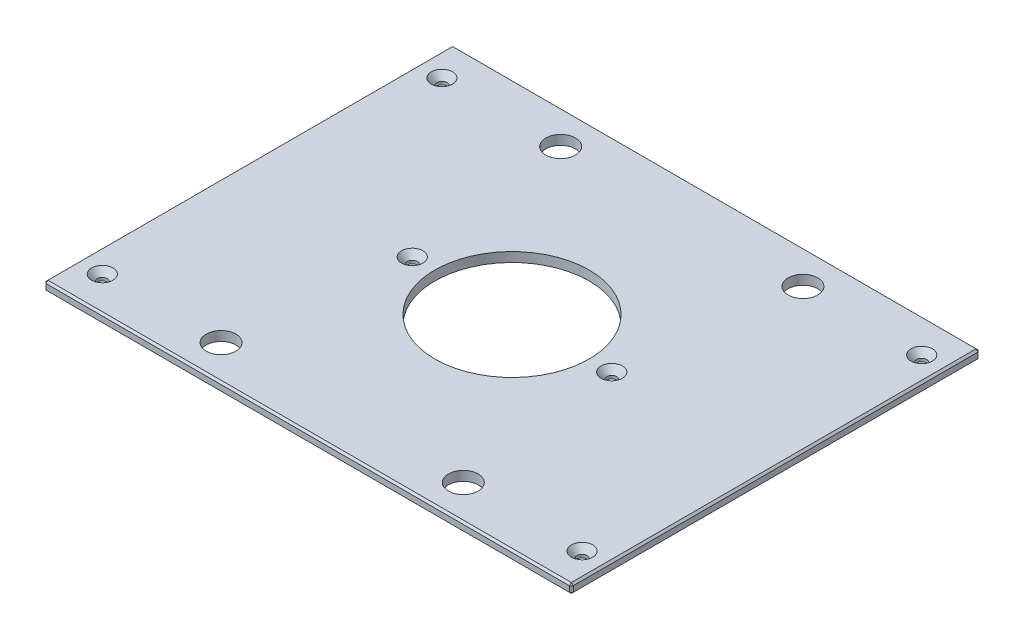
ISO-10303-21;
HEADER;
FILE_DESCRIPTION(('STEP AP214'),'2;1');
FILE_NAME('part.step','',(''),(''),'','','');
FILE_SCHEMA(('AUTOMOTIVE_DESIGN { 1 0 10303 214 1 1 1 1 }'));
ENDSEC;
DATA;
#1=APPLICATION_CONTEXT('core data for automotive mechanical design processes');
#2=APPLICATION_PROTOCOL_DEFINITION('international standard','automotive_design',2000,#1);
#3=PRODUCT_CONTEXT('',#1,'mechanical');
#4=PRODUCT('Part','Part','',(#3));
#5=PRODUCT_RELATED_PRODUCT_CATEGORY('part','',(#4));
#6=PRODUCT_DEFINITION_FORMATION('','',#4);
#7=PRODUCT_DEFINITION_CONTEXT('part definition',#1,'design');
#8=PRODUCT_DEFINITION('design','',#6,#7);
#9=PRODUCT_DEFINITION_SHAPE('','',#8);
#10=(LENGTH_UNIT() NAMED_UNIT(*) SI_UNIT(.MILLI.,.METRE.));
#11=(NAMED_UNIT(*) PLANE_ANGLE_UNIT() SI_UNIT($,.RADIAN.));
#12=(NAMED_UNIT(*) SI_UNIT($,.STERADIAN.) SOLID_ANGLE_UNIT());
#13=UNCERTAINTY_MEASURE_WITH_UNIT(LENGTH_MEASURE(1.E-05),#10,'distance_accuracy_value','');
#14=(GEOMETRIC_REPRESENTATION_CONTEXT(3) GLOBAL_UNCERTAINTY_ASSIGNED_CONTEXT((#13)) GLOBAL_UNIT_ASSIGNED_CONTEXT((#10,
#11,#12)) REPRESENTATION_CONTEXT('',''));
#15=CARTESIAN_POINT('',(0.,0.,0.));
#16=DIRECTION('',(0.,0.,1.));
#17=DIRECTION('',(1.,0.,0.));
#18=AXIS2_PLACEMENT_3D('',#15,#16,#17);
#19=CARTESIAN_POINT('',(-176.2125,6.35,-136.525));
#20=DIRECTION('',(1.,0.,0.));
#21=DIRECTION('',(0.,0.,-1.));
#22=AXIS2_PLACEMENT_3D('',#19,#20,#21);
#23=PLANE('',#22);
#24=DIRECTION('',(0.,0.,-1.));
#25=VECTOR('',#24,1.);
#26=CARTESIAN_POINT('',(-176.2125,5.08000000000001,-136.525));
#27=LINE('',#26,#25);
#28=CARTESIAN_POINT('',(-176.2125,5.08000000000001,135.255));
#29=VERTEX_POINT('',#28);
#30=CARTESIAN_POINT('',(-176.2125,5.08000000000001,-135.255));
#31=VERTEX_POINT('',#30);
#32=EDGE_CURVE('E135',#29,#31,#27,.T.);
#33=ORIENTED_EDGE('',*,*,#32,.T.);
#34=DIRECTION('',(0.,-1.,0.));
#35=VECTOR('',#34,1.);
#36=CARTESIAN_POINT('',(-176.2125,6.35,-135.255));
#37=LINE('',#36,#35);
#38=CARTESIAN_POINT('',(-176.2125,1.26999999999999,-135.255));
#39=VERTEX_POINT('',#38);
#40=EDGE_CURVE('E131',#31,#39,#37,.T.);
#41=ORIENTED_EDGE('',*,*,#40,.T.);
#42=DIRECTION('',(0.,0.,1.));
#43=VECTOR('',#42,1.);
#44=CARTESIAN_POINT('',(-176.2125,1.26999999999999,-136.525));
#45=LINE('',#44,#43);
#46=CARTESIAN_POINT('',(-176.2125,1.26999999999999,135.255));
#47=VERTEX_POINT('',#46);
#48=EDGE_CURVE('E126',#39,#47,#45,.T.);
#49=ORIENTED_EDGE('',*,*,#48,.T.);
#50=DIRECTION('',(0.,1.,0.));
#51=VECTOR('',#50,1.);
#52=CARTESIAN_POINT('',(-176.2125,6.35,135.255));
#53=LINE('',#52,#51);
#54=EDGE_CURVE('E128',#47,#29,#53,.T.);
#55=ORIENTED_EDGE('',*,*,#54,.T.);
#56=EDGE_LOOP('',(#33,#41,#49,#55));
#57=FACE_BOUND('',#56,.T.);
#58=ADVANCED_FACE('F35',(#57),#23,.F.);
#59=CARTESIAN_POINT('',(-176.2125,6.35,136.525));
#60=DIRECTION('',(0.,0.,-1.));
#61=DIRECTION('',(-1.,0.,0.));
#62=AXIS2_PLACEMENT_3D('',#59,#60,#61);
#63=PLANE('',#62);
#64=DIRECTION('',(1.,0.,0.));
#65=VECTOR('',#64,1.);
#66=CARTESIAN_POINT('',(-176.2125,1.26999999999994,136.525));
#67=LINE('',#66,#65);
#68=CARTESIAN_POINT('',(-174.9425,1.26999999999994,136.525));
#69=VERTEX_POINT('',#68);
#70=CARTESIAN_POINT('',(174.9425,1.26999999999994,136.525));
#71=VERTEX_POINT('',#70);
#72=EDGE_CURVE('E58',#69,#71,#67,.T.);
#73=ORIENTED_EDGE('',*,*,#72,.T.);
#74=DIRECTION('',(0.,1.,0.));
#75=VECTOR('',#74,1.);
#76=CARTESIAN_POINT('',(174.9425,6.35,136.525));
#77=LINE('',#76,#75);
#78=CARTESIAN_POINT('',(174.9425,5.08000000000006,136.525));
#79=VERTEX_POINT('',#78);
#80=EDGE_CURVE('E11',#71,#79,#77,.T.);
#81=ORIENTED_EDGE('',*,*,#80,.T.);
#82=DIRECTION('',(-1.,0.,0.));
#83=VECTOR('',#82,1.);
#84=CARTESIAN_POINT('',(-176.2125,5.08000000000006,136.525));
#85=LINE('',#84,#83);
#86=CARTESIAN_POINT('',(-174.9425,5.08000000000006,136.525));
#87=VERTEX_POINT('',#86);
#88=EDGE_CURVE('E44',#79,#87,#85,.T.);
#89=ORIENTED_EDGE('',*,*,#88,.T.);
#90=DIRECTION('',(0.,-1.,0.));
#91=VECTOR('',#90,1.);
#92=CARTESIAN_POINT('',(-174.9425,6.35,136.525));
#93=LINE('',#92,#91);
#94=EDGE_CURVE('E279',#87,#69,#93,.T.);
#95=ORIENTED_EDGE('',*,*,#94,.T.);
#96=EDGE_LOOP('',(#73,#81,#89,#95));
#97=FACE_BOUND('',#96,.T.);
#98=ADVANCED_FACE('F348',(#97),#63,.F.);
#99=CARTESIAN_POINT('',(176.2125,6.35,-136.525));
#100=DIRECTION('',(-1.,0.,0.));
#101=DIRECTION('',(0.,0.,1.));
#102=AXIS2_PLACEMENT_3D('',#99,#100,#101);
#103=PLANE('',#102);
#104=DIRECTION('',(0.,0.,-1.));
#105=VECTOR('',#104,1.);
#106=CARTESIAN_POINT('',(176.2125,1.26999999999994,-136.525));
#107=LINE('',#106,#105);
#108=CARTESIAN_POINT('',(176.2125,1.26999999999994,135.255));
#109=VERTEX_POINT('',#108);
#110=CARTESIAN_POINT('',(176.2125,1.26999999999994,-135.255));
#111=VERTEX_POINT('',#110);
#112=EDGE_CURVE('E274',#109,#111,#107,.T.);
#113=ORIENTED_EDGE('',*,*,#112,.T.);
#114=DIRECTION('',(0.,1.,0.));
#115=VECTOR('',#114,1.);
#116=CARTESIAN_POINT('',(176.2125,6.35,-135.255));
#117=LINE('',#116,#115);
#118=CARTESIAN_POINT('',(176.2125,5.08000000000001,-135.255));
#119=VERTEX_POINT('',#118);
#120=EDGE_CURVE('E276',#111,#119,#117,.T.);
#121=ORIENTED_EDGE('',*,*,#120,.T.);
#122=DIRECTION('',(0.,0.,1.));
#123=VECTOR('',#122,1.);
#124=CARTESIAN_POINT('',(176.2125,5.08000000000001,136.525));
#125=LINE('',#124,#123);
#126=CARTESIAN_POINT('',(176.2125,5.08000000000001,135.255));
#127=VERTEX_POINT('',#126);
#128=EDGE_CURVE('E272',#119,#127,#125,.T.);
#129=ORIENTED_EDGE('',*,*,#128,.T.);
#130=DIRECTION('',(0.,-1.,0.));
#131=VECTOR('',#130,1.);
#132=CARTESIAN_POINT('',(176.2125,6.35,135.255));
#133=LINE('',#132,#131);
#134=EDGE_CURVE('E270',#127,#109,#133,.T.);
#135=ORIENTED_EDGE('',*,*,#134,.T.);
#136=EDGE_LOOP('',(#113,#121,#129,#135));
#137=FACE_BOUND('',#136,.T.);
#138=ADVANCED_FACE('F335',(#137),#103,.F.);
#139=CARTESIAN_POINT('',(-176.2125,6.35,-136.525));
#140=DIRECTION('',(0.,0.,1.));
#141=DIRECTION('',(1.,0.,0.));
#142=AXIS2_PLACEMENT_3D('',#139,#140,#141);
#143=PLANE('',#142);
#144=DIRECTION('',(-1.,0.,0.));
#145=VECTOR('',#144,1.);
#146=CARTESIAN_POINT('',(-176.2125,1.26999999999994,-136.525));
#147=LINE('',#146,#145);
#148=CARTESIAN_POINT('',(174.9425,1.26999999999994,-136.525));
#149=VERTEX_POINT('',#148);
#150=CARTESIAN_POINT('',(-174.9425,1.26999999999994,-136.525));
#151=VERTEX_POINT('',#150);
#152=EDGE_CURVE('E246',#149,#151,#147,.T.);
#153=ORIENTED_EDGE('',*,*,#152,.T.);
#154=DIRECTION('',(0.,1.,0.));
#155=VECTOR('',#154,1.);
#156=CARTESIAN_POINT('',(-174.9425,6.35,-136.525));
#157=LINE('',#156,#155);
#158=CARTESIAN_POINT('',(-174.9425,5.08000000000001,-136.525));
#159=VERTEX_POINT('',#158);
#160=EDGE_CURVE('E250',#151,#159,#157,.T.);
#161=ORIENTED_EDGE('',*,*,#160,.T.);
#162=DIRECTION('',(1.,0.,0.));
#163=VECTOR('',#162,1.);
#164=CARTESIAN_POINT('',(176.2125,5.08000000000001,-136.525));
#165=LINE('',#164,#163);
#166=CARTESIAN_POINT('',(174.9425,5.08000000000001,-136.525));
#167=VERTEX_POINT('',#166);
#168=EDGE_CURVE('E248',#159,#167,#165,.T.);
#169=ORIENTED_EDGE('',*,*,#168,.T.);
#170=DIRECTION('',(0.,-1.,0.));
#171=VECTOR('',#170,1.);
#172=CARTESIAN_POINT('',(174.9425,6.35,-136.525));
#173=LINE('',#172,#171);
#174=EDGE_CURVE('E244',#167,#149,#173,.T.);
#175=ORIENTED_EDGE('',*,*,#174,.T.);
#176=EDGE_LOOP('',(#153,#161,#169,#175));
#177=FACE_BOUND('',#176,.T.);
#178=ADVANCED_FACE('F309',(#177),#143,.F.);
#179=CARTESIAN_POINT('',(0.,6.35,0.));
#180=DIRECTION('',(0.,1.,0.));
#181=DIRECTION('',(0.,0.,1.));
#182=AXIS2_PLACEMENT_3D('',#179,#180,#181);
#183=PLANE('',#182);
#184=CARTESIAN_POINT('',(160.3375,6.35,-113.50498));
#185=DIRECTION('',(0.,1.,0.));
#186=DIRECTION('',(0.,0.,1.));
#187=AXIS2_PLACEMENT_3D('',#184,#185,#186);
#188=CIRCLE('',#187,7.13739999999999);
#189=CARTESIAN_POINT('',(160.3375,6.35,-106.36758));
#190=VERTEX_POINT('',#189);
#191=EDGE_CURVE('E752',#190,#190,#188,.T.);
#192=ORIENTED_EDGE('',*,*,#191,.F.);
#193=EDGE_LOOP('',(#192));
#194=FACE_BOUND('',#193,.T.);
#195=CARTESIAN_POINT('',(160.3375,6.35,113.50498));
#196=DIRECTION('',(0.,1.,0.));
#197=DIRECTION('',(0.,0.,1.));
#198=AXIS2_PLACEMENT_3D('',#195,#196,#197);
#199=CIRCLE('',#198,7.13739999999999);
#200=CARTESIAN_POINT('',(160.3375,6.35,120.64238));
#201=VERTEX_POINT('',#200);
#202=EDGE_CURVE('E756',#201,#201,#199,.T.);
#203=ORIENTED_EDGE('',*,*,#202,.F.);
#204=EDGE_LOOP('',(#203));
#205=FACE_BOUND('',#204,.T.);
#206=CARTESIAN_POINT('',(-160.3375,6.35,113.50498));
#207=DIRECTION('',(0.,1.,0.));
#208=DIRECTION('',(0.,0.,1.));
#209=AXIS2_PLACEMENT_3D('',#206,#207,#208);
#210=CIRCLE('',#209,7.13739999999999);
#211=CARTESIAN_POINT('',(-160.3375,6.35,120.64238));
#212=VERTEX_POINT('',#211);
#213=EDGE_CURVE('E760',#212,#212,#210,.T.);
#214=ORIENTED_EDGE('',*,*,#213,.F.);
#215=EDGE_LOOP('',(#214));
#216=FACE_BOUND('',#215,.T.);
#217=CARTESIAN_POINT('',(-66.675,6.35,0.));
#218=DIRECTION('',(0.,1.,0.));
#219=DIRECTION('',(0.,0.,1.));
#220=AXIS2_PLACEMENT_3D('',#217,#218,#219);
#221=CIRCLE('',#220,7.1374);
#222=CARTESIAN_POINT('',(-66.675,6.35,7.1374));
#223=VERTEX_POINT('',#222);
#224=EDGE_CURVE('E764',#223,#223,#221,.T.);
#225=ORIENTED_EDGE('',*,*,#224,.F.);
#226=EDGE_LOOP('',(#225));
#227=FACE_BOUND('',#226,.T.);
#228=CARTESIAN_POINT('',(66.675,6.35,0.));
#229=DIRECTION('',(0.,1.,0.));
#230=DIRECTION('',(0.,0.,1.));
#231=AXIS2_PLACEMENT_3D('',#228,#229,#230);
#232=CIRCLE('',#231,7.1374);
#233=CARTESIAN_POINT('',(66.675,6.35,7.1374));
#234=VERTEX_POINT('',#233);
#235=EDGE_CURVE('E768',#234,#234,#232,.T.);
#236=ORIENTED_EDGE('',*,*,#235,.F.);
#237=EDGE_LOOP('',(#236));
#238=FACE_BOUND('',#237,.T.);
#239=CARTESIAN_POINT('',(-160.3375,6.35,-113.50498));
#240=DIRECTION('',(0.,1.,0.));
#241=DIRECTION('',(0.,0.,1.));
#242=AXIS2_PLACEMENT_3D('',#239,#240,#241);
#243=CIRCLE('',#242,7.13739999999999);
#244=CARTESIAN_POINT('',(-160.3375,6.35,-106.36758));
#245=VERTEX_POINT('',#244);
#246=EDGE_CURVE('E771',#245,#245,#243,.T.);
#247=ORIENTED_EDGE('',*,*,#246,.F.);
#248=EDGE_LOOP('',(#247));
#249=FACE_BOUND('',#248,.T.);
#250=DIRECTION('',(0.,0.,-1.));
#251=VECTOR('',#250,1.);
#252=CARTESIAN_POINT('',(174.9425,6.35,-136.525));
#253=LINE('',#252,#251);
#254=CARTESIAN_POINT('',(174.9425,6.35,135.255));
#255=VERTEX_POINT('',#254);
#256=CARTESIAN_POINT('',(174.9425,6.35,-135.255));
#257=VERTEX_POINT('',#256);
#258=EDGE_CURVE('E257',#255,#257,#253,.T.);
#259=ORIENTED_EDGE('',*,*,#258,.T.);
#260=DIRECTION('',(-1.,0.,0.));
#261=VECTOR('',#260,1.);
#262=CARTESIAN_POINT('',(-176.2125,6.35,-135.255));
#263=LINE('',#262,#261);
#264=CARTESIAN_POINT('',(-174.9425,6.35,-135.255));
#265=VERTEX_POINT('',#264);
#266=EDGE_CURVE('E259',#257,#265,#263,.T.);
#267=ORIENTED_EDGE('',*,*,#266,.T.);
#268=DIRECTION('',(0.,0.,1.));
#269=VECTOR('',#268,1.);
#270=CARTESIAN_POINT('',(-174.9425,6.35,136.525));
#271=LINE('',#270,#269);
#272=CARTESIAN_POINT('',(-174.9425,6.35,135.255));
#273=VERTEX_POINT('',#272);
#274=EDGE_CURVE('E255',#265,#273,#271,.T.);
#275=ORIENTED_EDGE('',*,*,#274,.T.);
#276=DIRECTION('',(1.,0.,0.));
#277=VECTOR('',#276,1.);
#278=CARTESIAN_POINT('',(176.2125,6.35,135.255));
#279=LINE('',#278,#277);
#280=EDGE_CURVE('E253',#273,#255,#279,.T.);
#281=ORIENTED_EDGE('',*,*,#280,.T.);
#282=EDGE_LOOP('',(#259,#267,#275,#281));
#283=FACE_BOUND('',#282,.T.);
#284=CARTESIAN_POINT('',(80.9625,6.35,-113.50498));
#285=DIRECTION('',(0.,1.,0.));
#286=DIRECTION('',(0.,0.,1.));
#287=AXIS2_PLACEMENT_3D('',#284,#285,#286);
#288=CIRCLE('',#287,9.921875);
#289=CARTESIAN_POINT('',(80.9625,6.35,-103.583105));
#290=VERTEX_POINT('',#289);
#291=EDGE_CURVE('E204',#290,#290,#288,.T.);
#292=ORIENTED_EDGE('',*,*,#291,.F.);
#293=EDGE_LOOP('',(#292));
#294=FACE_BOUND('',#293,.T.);
#295=CARTESIAN_POINT('',(-80.9625,6.35,-113.50498));
#296=DIRECTION('',(0.,1.,0.));
#297=DIRECTION('',(0.,0.,1.));
#298=AXIS2_PLACEMENT_3D('',#295,#296,#297);
#299=CIRCLE('',#298,9.921875);
#300=CARTESIAN_POINT('',(-80.9625,6.35,-103.583105));
#301=VERTEX_POINT('',#300);
#302=EDGE_CURVE('E214',#301,#301,#299,.T.);
#303=ORIENTED_EDGE('',*,*,#302,.F.);
#304=EDGE_LOOP('',(#303));
#305=FACE_BOUND('',#304,.T.);
#306=CARTESIAN_POINT('',(80.9625,6.35,113.50498));
#307=DIRECTION('',(0.,1.,0.));
#308=DIRECTION('',(0.,0.,1.));
#309=AXIS2_PLACEMENT_3D('',#306,#307,#308);
#310=CIRCLE('',#309,9.921875);
#311=CARTESIAN_POINT('',(80.9625,6.35,123.426855));
#312=VERTEX_POINT('',#311);
#313=EDGE_CURVE('E225',#312,#312,#310,.T.);
#314=ORIENTED_EDGE('',*,*,#313,.F.);
#315=EDGE_LOOP('',(#314));
#316=FACE_BOUND('',#315,.T.);
#317=CARTESIAN_POINT('',(-80.9625,6.35,113.50498));
#318=DIRECTION('',(0.,1.,0.));
#319=DIRECTION('',(0.,0.,1.));
#320=AXIS2_PLACEMENT_3D('',#317,#318,#319);
#321=CIRCLE('',#320,9.921875);
#322=CARTESIAN_POINT('',(-80.9625,6.35,123.426855));
#323=VERTEX_POINT('',#322);
#324=EDGE_CURVE('E231',#323,#323,#321,.T.);
#325=ORIENTED_EDGE('',*,*,#324,.F.);
#326=EDGE_LOOP('',(#325));
#327=FACE_BOUND('',#326,.T.);
#328=CARTESIAN_POINT('',(0.,6.35,0.));
#329=DIRECTION('',(0.,1.,0.));
#330=DIRECTION('',(0.,0.,1.));
#331=AXIS2_PLACEMENT_3D('',#328,#329,#330);
#332=CIRCLE('',#331,51.562);
#333=CARTESIAN_POINT('',(0.,6.35,51.562));
#334=VERTEX_POINT('',#333);
#335=EDGE_CURVE('E237',#334,#334,#332,.T.);
#336=ORIENTED_EDGE('',*,*,#335,.F.);
#337=EDGE_LOOP('',(#336));
#338=FACE_BOUND('',#337,.T.);
#339=ADVANCED_FACE('F357',(#194,#205,#216,#227,#238,#249,#283,#294,#305,#316,#327,#338),#183,.T.);
#340=CARTESIAN_POINT('',(0.,0.,0.));
#341=DIRECTION('',(0.,1.,0.));
#342=DIRECTION('',(0.,0.,1.));
#343=AXIS2_PLACEMENT_3D('',#340,#341,#342);
#344=PLANE('',#343);
#345=CARTESIAN_POINT('',(160.3375,0.,-113.50498));
#346=DIRECTION('',(0.,1.,0.));
#347=DIRECTION('',(0.,0.,1.));
#348=AXIS2_PLACEMENT_3D('',#345,#346,#347);
#349=CIRCLE('',#348,3.3782);
#350=CARTESIAN_POINT('',(160.3375,0.,-110.12678));
#351=VERTEX_POINT('',#350);
#352=EDGE_CURVE('E805',#351,#351,#349,.T.);
#353=ORIENTED_EDGE('',*,*,#352,.T.);
#354=EDGE_LOOP('',(#353));
#355=FACE_BOUND('',#354,.T.);
#356=CARTESIAN_POINT('',(160.3375,0.,113.50498));
#357=DIRECTION('',(0.,1.,0.));
#358=DIRECTION('',(0.,0.,1.));
#359=AXIS2_PLACEMENT_3D('',#356,#357,#358);
#360=CIRCLE('',#359,3.3782);
#361=CARTESIAN_POINT('',(160.3375,0.,116.88318));
#362=VERTEX_POINT('',#361);
#363=EDGE_CURVE('E798',#362,#362,#360,.T.);
#364=ORIENTED_EDGE('',*,*,#363,.T.);
#365=EDGE_LOOP('',(#364));
#366=FACE_BOUND('',#365,.T.);
#367=CARTESIAN_POINT('',(-160.3375,0.,113.50498));
#368=DIRECTION('',(0.,1.,0.));
#369=DIRECTION('',(0.,0.,1.));
#370=AXIS2_PLACEMENT_3D('',#367,#368,#369);
#371=CIRCLE('',#370,3.3782);
#372=CARTESIAN_POINT('',(-160.3375,0.,116.88318));
#373=VERTEX_POINT('',#372);
#374=EDGE_CURVE('E791',#373,#373,#371,.T.);
#375=ORIENTED_EDGE('',*,*,#374,.T.);
#376=EDGE_LOOP('',(#375));
#377=FACE_BOUND('',#376,.T.);
#378=CARTESIAN_POINT('',(-66.675,0.,0.));
#379=DIRECTION('',(0.,1.,0.));
#380=DIRECTION('',(0.,0.,1.));
#381=AXIS2_PLACEMENT_3D('',#378,#379,#380);
#382=CIRCLE('',#381,3.3782);
#383=CARTESIAN_POINT('',(-66.675,0.,3.3782));
#384=VERTEX_POINT('',#383);
#385=EDGE_CURVE('E784',#384,#384,#382,.T.);
#386=ORIENTED_EDGE('',*,*,#385,.T.);
#387=EDGE_LOOP('',(#386));
#388=FACE_BOUND('',#387,.T.);
#389=CARTESIAN_POINT('',(66.675,0.,0.));
#390=DIRECTION('',(0.,1.,0.));
#391=DIRECTION('',(0.,0.,1.));
#392=AXIS2_PLACEMENT_3D('',#389,#390,#391);
#393=CIRCLE('',#392,3.3782);
#394=CARTESIAN_POINT('',(66.675,0.,3.3782));
#395=VERTEX_POINT('',#394);
#396=EDGE_CURVE('E774',#395,#395,#393,.T.);
#397=ORIENTED_EDGE('',*,*,#396,.T.);
#398=EDGE_LOOP('',(#397));
#399=FACE_BOUND('',#398,.T.);
#400=CARTESIAN_POINT('',(-160.3375,0.,-113.50498));
#401=DIRECTION('',(0.,1.,0.));
#402=DIRECTION('',(0.,0.,1.));
#403=AXIS2_PLACEMENT_3D('',#400,#401,#402);
#404=CIRCLE('',#403,3.3782);
#405=CARTESIAN_POINT('',(-160.3375,0.,-110.12678));
#406=VERTEX_POINT('',#405);
#407=EDGE_CURVE('E217',#406,#406,#404,.T.);
#408=ORIENTED_EDGE('',*,*,#407,.T.);
#409=EDGE_LOOP('',(#408));
#410=FACE_BOUND('',#409,.T.);
#411=DIRECTION('',(0.,0.,-1.));
#412=VECTOR('',#411,1.);
#413=CARTESIAN_POINT('',(-174.9425,0.,0.));
#414=LINE('',#413,#412);
#415=CARTESIAN_POINT('',(-174.9425,0.,135.255));
#416=VERTEX_POINT('',#415);
#417=CARTESIAN_POINT('',(-174.9425,0.,-135.255));
#418=VERTEX_POINT('',#417);
#419=EDGE_CURVE('E158',#416,#418,#414,.T.);
#420=ORIENTED_EDGE('',*,*,#419,.T.);
#421=DIRECTION('',(1.,0.,0.));
#422=VECTOR('',#421,1.);
#423=CARTESIAN_POINT('',(0.,0.,-135.255));
#424=LINE('',#423,#422);
#425=CARTESIAN_POINT('',(174.9425,0.,-135.255));
#426=VERTEX_POINT('',#425);
#427=EDGE_CURVE('E267',#418,#426,#424,.T.);
#428=ORIENTED_EDGE('',*,*,#427,.T.);
#429=DIRECTION('',(0.,0.,1.));
#430=VECTOR('',#429,1.);
#431=CARTESIAN_POINT('',(174.9425,0.,0.));
#432=LINE('',#431,#430);
#433=CARTESIAN_POINT('',(174.9425,0.,135.255));
#434=VERTEX_POINT('',#433);
#435=EDGE_CURVE('E265',#426,#434,#432,.T.);
#436=ORIENTED_EDGE('',*,*,#435,.T.);
#437=DIRECTION('',(-1.,0.,0.));
#438=VECTOR('',#437,1.);
#439=CARTESIAN_POINT('',(0.,0.,135.255));
#440=LINE('',#439,#438);
#441=EDGE_CURVE('E262',#434,#416,#440,.T.);
#442=ORIENTED_EDGE('',*,*,#441,.T.);
#443=EDGE_LOOP('',(#420,#428,#436,#442));
#444=FACE_BOUND('',#443,.T.);
#445=CARTESIAN_POINT('',(80.9625,0.,-113.50498));
#446=DIRECTION('',(0.,1.,0.));
#447=DIRECTION('',(0.,0.,1.));
#448=AXIS2_PLACEMENT_3D('',#445,#446,#447);
#449=CIRCLE('',#448,9.921875);
#450=CARTESIAN_POINT('',(80.9625,0.,-103.583105));
#451=VERTEX_POINT('',#450);
#452=EDGE_CURVE('E209',#451,#451,#449,.T.);
#453=ORIENTED_EDGE('',*,*,#452,.T.);
#454=EDGE_LOOP('',(#453));
#455=FACE_BOUND('',#454,.T.);
#456=CARTESIAN_POINT('',(-80.9625,0.,-113.50498));
#457=DIRECTION('',(0.,1.,0.));
#458=DIRECTION('',(0.,0.,1.));
#459=AXIS2_PLACEMENT_3D('',#456,#457,#458);
#460=CIRCLE('',#459,9.921875);
#461=CARTESIAN_POINT('',(-80.9625,0.,-103.583105));
#462=VERTEX_POINT('',#461);
#463=EDGE_CURVE('E222',#462,#462,#460,.T.);
#464=ORIENTED_EDGE('',*,*,#463,.T.);
#465=EDGE_LOOP('',(#464));
#466=FACE_BOUND('',#465,.T.);
#467=CARTESIAN_POINT('',(80.9625,0.,113.50498));
#468=DIRECTION('',(0.,1.,0.));
#469=DIRECTION('',(0.,0.,1.));
#470=AXIS2_PLACEMENT_3D('',#467,#468,#469);
#471=CIRCLE('',#470,9.921875);
#472=CARTESIAN_POINT('',(80.9625,0.,123.426855));
#473=VERTEX_POINT('',#472);
#474=EDGE_CURVE('E228',#473,#473,#471,.T.);
#475=ORIENTED_EDGE('',*,*,#474,.T.);
#476=EDGE_LOOP('',(#475));
#477=FACE_BOUND('',#476,.T.);
#478=CARTESIAN_POINT('',(-80.9625,0.,113.50498));
#479=DIRECTION('',(0.,1.,0.));
#480=DIRECTION('',(0.,0.,1.));
#481=AXIS2_PLACEMENT_3D('',#478,#479,#480);
#482=CIRCLE('',#481,9.921875);
#483=CARTESIAN_POINT('',(-80.9625,0.,123.426855));
#484=VERTEX_POINT('',#483);
#485=EDGE_CURVE('E234',#484,#484,#482,.T.);
#486=ORIENTED_EDGE('',*,*,#485,.T.);
#487=EDGE_LOOP('',(#486));
#488=FACE_BOUND('',#487,.T.);
#489=CARTESIAN_POINT('',(0.,0.,0.));
#490=DIRECTION('',(0.,1.,0.));
#491=DIRECTION('',(0.,0.,1.));
#492=AXIS2_PLACEMENT_3D('',#489,#490,#491);
#493=CIRCLE('',#492,51.562);
#494=CARTESIAN_POINT('',(0.,0.,51.562));
#495=VERTEX_POINT('',#494);
#496=EDGE_CURVE('E147',#495,#495,#493,.T.);
#497=ORIENTED_EDGE('',*,*,#496,.T.);
#498=EDGE_LOOP('',(#497));
#499=FACE_BOUND('',#498,.T.);
#500=ADVANCED_FACE('F322',(#355,#366,#377,#388,#399,#410,#444,#455,#466,#477,#488,#499),#344,.F.);
#501=CARTESIAN_POINT('',(0.,0.,0.));
#502=DIRECTION('',(0.,1.,0.));
#503=DIRECTION('',(0.,0.,1.));
#504=AXIS2_PLACEMENT_3D('',#501,#502,#503);
#505=CYLINDRICAL_SURFACE('',#504,51.562);
#506=ORIENTED_EDGE('',*,*,#496,.F.);
#507=EDGE_LOOP('',(#506));
#508=FACE_BOUND('',#507,.T.);
#509=ORIENTED_EDGE('',*,*,#335,.T.);
#510=EDGE_LOOP('',(#509));
#511=FACE_BOUND('',#510,.T.);
#512=ADVANCED_FACE('F691',(#508,#511),#505,.F.);
#513=CARTESIAN_POINT('',(-80.9625,6.35,113.50498));
#514=DIRECTION('',(0.,1.,0.));
#515=DIRECTION('',(0.,0.,1.));
#516=AXIS2_PLACEMENT_3D('',#513,#514,#515);
#517=CYLINDRICAL_SURFACE('',#516,9.921875);
#518=ORIENTED_EDGE('',*,*,#485,.F.);
#519=EDGE_LOOP('',(#518));
#520=FACE_BOUND('',#519,.T.);
#521=ORIENTED_EDGE('',*,*,#324,.T.);
#522=EDGE_LOOP('',(#521));
#523=FACE_BOUND('',#522,.T.);
#524=ADVANCED_FACE('F682',(#520,#523),#517,.F.);
#525=CARTESIAN_POINT('',(80.9625,6.35,113.50498));
#526=DIRECTION('',(0.,1.,0.));
#527=DIRECTION('',(0.,0.,1.));
#528=AXIS2_PLACEMENT_3D('',#525,#526,#527);
#529=CYLINDRICAL_SURFACE('',#528,9.921875);
#530=ORIENTED_EDGE('',*,*,#474,.F.);
#531=EDGE_LOOP('',(#530));
#532=FACE_BOUND('',#531,.T.);
#533=ORIENTED_EDGE('',*,*,#313,.T.);
#534=EDGE_LOOP('',(#533));
#535=FACE_BOUND('',#534,.T.);
#536=ADVANCED_FACE('F673',(#532,#535),#529,.F.);
#537=CARTESIAN_POINT('',(-80.9625,6.35,-113.50498));
#538=DIRECTION('',(0.,1.,0.));
#539=DIRECTION('',(0.,0.,1.));
#540=AXIS2_PLACEMENT_3D('',#537,#538,#539);
#541=CYLINDRICAL_SURFACE('',#540,9.921875);
#542=ORIENTED_EDGE('',*,*,#463,.F.);
#543=EDGE_LOOP('',(#542));
#544=FACE_BOUND('',#543,.T.);
#545=ORIENTED_EDGE('',*,*,#302,.T.);
#546=EDGE_LOOP('',(#545));
#547=FACE_BOUND('',#546,.T.);
#548=ADVANCED_FACE('F663',(#544,#547),#541,.F.);
#549=CARTESIAN_POINT('',(80.9625,6.35,-113.50498));
#550=DIRECTION('',(0.,1.,0.));
#551=DIRECTION('',(0.,0.,1.));
#552=AXIS2_PLACEMENT_3D('',#549,#550,#551);
#553=CYLINDRICAL_SURFACE('',#552,9.921875);
#554=ORIENTED_EDGE('',*,*,#452,.F.);
#555=EDGE_LOOP('',(#554));
#556=FACE_BOUND('',#555,.T.);
#557=ORIENTED_EDGE('',*,*,#291,.T.);
#558=EDGE_LOOP('',(#557));
#559=FACE_BOUND('',#558,.T.);
#560=ADVANCED_FACE('F366',(#556,#559),#553,.F.);
#561=CARTESIAN_POINT('',(176.2125,6.35,135.255));
#562=DIRECTION('',(-0.707106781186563,0.,-0.707106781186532));
#563=DIRECTION('',(0.,-1.,0.));
#564=AXIS2_PLACEMENT_3D('',#561,#562,#563);
#565=PLANE('',#564);
#566=DIRECTION('',(-0.707106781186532,0.,0.707106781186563));
#567=VECTOR('',#566,1.);
#568=CARTESIAN_POINT('',(176.2125,5.08000000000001,135.255));
#569=LINE('',#568,#567);
#570=EDGE_CURVE('E39',#79,#127,#569,.F.);
#571=ORIENTED_EDGE('',*,*,#570,.F.);
#572=ORIENTED_EDGE('',*,*,#80,.F.);
#573=DIRECTION('',(0.707106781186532,0.,-0.707106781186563));
#574=VECTOR('',#573,1.);
#575=CARTESIAN_POINT('',(175.5775,1.26999999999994,135.89));
#576=LINE('',#575,#574);
#577=EDGE_CURVE('E197',#109,#71,#576,.F.);
#578=ORIENTED_EDGE('',*,*,#577,.F.);
#579=ORIENTED_EDGE('',*,*,#134,.F.);
#580=EDGE_LOOP('',(#571,#572,#578,#579));
#581=FACE_BOUND('',#580,.T.);
#582=ADVANCED_FACE('F37',(#581),#565,.F.);
#583=CARTESIAN_POINT('',(176.2125,5.08000000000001,135.255));
#584=DIRECTION('',(0.577350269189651,0.577350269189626,0.577350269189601));
#585=DIRECTION('',(-0.707106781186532,0.707106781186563,0.));
#586=AXIS2_PLACEMENT_3D('',#583,#584,#585);
#587=PLANE('',#586);
#588=DIRECTION('',(0.,-0.707106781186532,0.707106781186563));
#589=VECTOR('',#588,1.);
#590=CARTESIAN_POINT('',(174.9425,5.71500000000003,135.89));
#591=LINE('',#590,#589);
#592=EDGE_CURVE('E193',#79,#255,#591,.F.);
#593=ORIENTED_EDGE('',*,*,#592,.F.);
#594=ORIENTED_EDGE('',*,*,#570,.T.);
#595=DIRECTION('',(-0.707106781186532,0.707106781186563,0.));
#596=VECTOR('',#595,1.);
#597=CARTESIAN_POINT('',(176.2125,5.08000000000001,135.255));
#598=LINE('',#597,#596);
#599=EDGE_CURVE('E195',#255,#127,#598,.F.);
#600=ORIENTED_EDGE('',*,*,#599,.F.);
#601=EDGE_LOOP('',(#593,#594,#600));
#602=FACE_BOUND('',#601,.T.);
#603=ADVANCED_FACE('F359',(#602),#587,.T.);
#604=CARTESIAN_POINT('',(174.9425,0.,135.255));
#605=DIRECTION('',(0.577350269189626,-0.577350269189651,0.577350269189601));
#606=DIRECTION('',(0.707106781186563,0.707106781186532,0.));
#607=AXIS2_PLACEMENT_3D('',#604,#605,#606);
#608=PLANE('',#607);
#609=DIRECTION('',(-0.707106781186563,-0.707106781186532,0.));
#610=VECTOR('',#609,1.);
#611=CARTESIAN_POINT('',(174.9425,0.,135.255));
#612=LINE('',#611,#610);
#613=EDGE_CURVE('E187',#109,#434,#612,.T.);
#614=ORIENTED_EDGE('',*,*,#613,.F.);
#615=ORIENTED_EDGE('',*,*,#577,.T.);
#616=DIRECTION('',(0.,0.707106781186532,0.707106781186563));
#617=VECTOR('',#616,1.);
#618=CARTESIAN_POINT('',(174.9425,0.,135.255));
#619=LINE('',#618,#617);
#620=EDGE_CURVE('E190',#434,#71,#619,.T.);
#621=ORIENTED_EDGE('',*,*,#620,.F.);
#622=EDGE_LOOP('',(#614,#615,#621));
#623=FACE_BOUND('',#622,.T.);
#624=ADVANCED_FACE('F328',(#623),#608,.T.);
#625=CARTESIAN_POINT('',(174.9425,6.35,0.));
#626=DIRECTION('',(0.707106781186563,0.707106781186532,0.));
#627=DIRECTION('',(0.,0.,1.));
#628=AXIS2_PLACEMENT_3D('',#625,#626,#627);
#629=PLANE('',#628);
#630=ORIENTED_EDGE('',*,*,#599,.T.);
#631=ORIENTED_EDGE('',*,*,#128,.F.);
#632=DIRECTION('',(0.707106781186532,-0.707106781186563,0.));
#633=VECTOR('',#632,1.);
#634=CARTESIAN_POINT('',(175.5775,5.715,-135.255));
#635=LINE('',#634,#633);
#636=EDGE_CURVE('E182',#257,#119,#635,.T.);
#637=ORIENTED_EDGE('',*,*,#636,.F.);
#638=ORIENTED_EDGE('',*,*,#258,.F.);
#639=EDGE_LOOP('',(#630,#631,#637,#638));
#640=FACE_BOUND('',#639,.T.);
#641=ADVANCED_FACE('F345',(#640),#629,.T.);
#642=CARTESIAN_POINT('',(0.,6.35,135.255));
#643=DIRECTION('',(0.,0.707106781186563,0.707106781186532));
#644=DIRECTION('',(-1.,0.,0.));
#645=AXIS2_PLACEMENT_3D('',#642,#643,#644);
#646=PLANE('',#645);
#647=ORIENTED_EDGE('',*,*,#592,.T.);
#648=ORIENTED_EDGE('',*,*,#280,.F.);
#649=DIRECTION('',(0.,0.707106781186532,-0.707106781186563));
#650=VECTOR('',#649,1.);
#651=CARTESIAN_POINT('',(-174.9425,6.35,135.255));
#652=LINE('',#651,#650);
#653=EDGE_CURVE('E179',#87,#273,#652,.T.);
#654=ORIENTED_EDGE('',*,*,#653,.F.);
#655=ORIENTED_EDGE('',*,*,#88,.F.);
#656=EDGE_LOOP('',(#647,#648,#654,#655));
#657=FACE_BOUND('',#656,.T.);
#658=ADVANCED_FACE('F350',(#657),#646,.T.);
#659=CARTESIAN_POINT('',(-174.9425,6.35,136.525));
#660=DIRECTION('',(0.707106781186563,0.,-0.707106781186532));
#661=DIRECTION('',(0.,-1.,0.));
#662=AXIS2_PLACEMENT_3D('',#659,#660,#661);
#663=PLANE('',#662);
#664=DIRECTION('',(0.707106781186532,0.,0.707106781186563));
#665=VECTOR('',#664,1.);
#666=CARTESIAN_POINT('',(-176.2125,1.26999999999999,135.255));
#667=LINE('',#666,#665);
#668=EDGE_CURVE('E142',#69,#47,#667,.F.);
#669=ORIENTED_EDGE('',*,*,#668,.F.);
#670=ORIENTED_EDGE('',*,*,#94,.F.);
#671=DIRECTION('',(-0.707106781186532,0.,-0.707106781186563));
#672=VECTOR('',#671,1.);
#673=CARTESIAN_POINT('',(-175.5775,5.08000000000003,135.89));
#674=LINE('',#673,#672);
#675=EDGE_CURVE('E145',#29,#87,#674,.F.);
#676=ORIENTED_EDGE('',*,*,#675,.F.);
#677=ORIENTED_EDGE('',*,*,#54,.F.);
#678=EDGE_LOOP('',(#669,#670,#676,#677));
#679=FACE_BOUND('',#678,.T.);
#680=ADVANCED_FACE('F140',(#679),#663,.F.);
#681=CARTESIAN_POINT('',(-176.2125,1.26999999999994,136.525));
#682=DIRECTION('',(0.,0.707106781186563,-0.707106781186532));
#683=DIRECTION('',(1.,0.,0.));
#684=AXIS2_PLACEMENT_3D('',#681,#682,#683);
#685=PLANE('',#684);
#686=ORIENTED_EDGE('',*,*,#620,.T.);
#687=ORIENTED_EDGE('',*,*,#72,.F.);
#688=DIRECTION('',(0.,-0.707106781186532,-0.707106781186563));
#689=VECTOR('',#688,1.);
#690=CARTESIAN_POINT('',(-174.9425,0.634999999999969,135.89));
#691=LINE('',#690,#689);
#692=EDGE_CURVE('E155',#416,#69,#691,.F.);
#693=ORIENTED_EDGE('',*,*,#692,.F.);
#694=ORIENTED_EDGE('',*,*,#441,.F.);
#695=EDGE_LOOP('',(#686,#687,#693,#694));
#696=FACE_BOUND('',#695,.T.);
#697=ADVANCED_FACE('F327',(#696),#685,.F.);
#698=CARTESIAN_POINT('',(176.2125,1.26999999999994,-136.525));
#699=DIRECTION('',(-0.707106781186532,0.707106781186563,0.));
#700=DIRECTION('',(0.,0.,-1.));
#701=AXIS2_PLACEMENT_3D('',#698,#699,#700);
#702=PLANE('',#701);
#703=ORIENTED_EDGE('',*,*,#613,.T.);
#704=ORIENTED_EDGE('',*,*,#435,.F.);
#705=DIRECTION('',(0.707106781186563,0.707106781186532,0.));
#706=VECTOR('',#705,1.);
#707=CARTESIAN_POINT('',(174.9425,0.,-135.255));
#708=LINE('',#707,#706);
#709=EDGE_CURVE('E174',#111,#426,#708,.F.);
#710=ORIENTED_EDGE('',*,*,#709,.F.);
#711=ORIENTED_EDGE('',*,*,#112,.F.);
#712=EDGE_LOOP('',(#703,#704,#710,#711));
#713=FACE_BOUND('',#712,.T.);
#714=ADVANCED_FACE('F332',(#713),#702,.F.);
#715=CARTESIAN_POINT('',(174.9425,6.35,-136.525));
#716=DIRECTION('',(-0.707106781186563,0.,0.707106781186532));
#717=DIRECTION('',(0.,-1.,0.));
#718=AXIS2_PLACEMENT_3D('',#715,#716,#717);
#719=PLANE('',#718);
#720=DIRECTION('',(0.707106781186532,0.,0.707106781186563));
#721=VECTOR('',#720,1.);
#722=CARTESIAN_POINT('',(174.9425,5.08000000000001,-136.525));
#723=LINE('',#722,#721);
#724=EDGE_CURVE('E184',#119,#167,#723,.F.);
#725=ORIENTED_EDGE('',*,*,#724,.F.);
#726=ORIENTED_EDGE('',*,*,#120,.F.);
#727=DIRECTION('',(-0.707106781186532,0.,-0.707106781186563));
#728=VECTOR('',#727,1.);
#729=CARTESIAN_POINT('',(175.5775,1.26999999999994,-135.89));
#730=LINE('',#729,#728);
#731=EDGE_CURVE('E171',#149,#111,#730,.F.);
#732=ORIENTED_EDGE('',*,*,#731,.F.);
#733=ORIENTED_EDGE('',*,*,#174,.F.);
#734=EDGE_LOOP('',(#725,#726,#732,#733));
#735=FACE_BOUND('',#734,.T.);
#736=ADVANCED_FACE('F340',(#735),#719,.F.);
#737=CARTESIAN_POINT('',(174.9425,5.08000000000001,-136.525));
#738=DIRECTION('',(0.577350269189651,0.577350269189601,-0.577350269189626));
#739=DIRECTION('',(-0.707106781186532,0.,-0.707106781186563));
#740=AXIS2_PLACEMENT_3D('',#737,#738,#739);
#741=PLANE('',#740);
#742=ORIENTED_EDGE('',*,*,#636,.T.);
#743=ORIENTED_EDGE('',*,*,#724,.T.);
#744=DIRECTION('',(0.,0.707106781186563,0.707106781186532));
#745=VECTOR('',#744,1.);
#746=CARTESIAN_POINT('',(174.9425,5.08000000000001,-136.525));
#747=LINE('',#746,#745);
#748=EDGE_CURVE('E163',#257,#167,#747,.F.);
#749=ORIENTED_EDGE('',*,*,#748,.F.);
#750=EDGE_LOOP('',(#742,#743,#749));
#751=FACE_BOUND('',#750,.T.);
#752=ADVANCED_FACE('F398',(#751),#741,.T.);
#753=CARTESIAN_POINT('',(-174.9425,6.35,135.255));
#754=DIRECTION('',(-0.577350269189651,0.577350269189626,0.577350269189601));
#755=DIRECTION('',(-0.707106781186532,-0.707106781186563,0.));
#756=AXIS2_PLACEMENT_3D('',#753,#754,#755);
#757=PLANE('',#756);
#758=ORIENTED_EDGE('',*,*,#675,.T.);
#759=ORIENTED_EDGE('',*,*,#653,.T.);
#760=DIRECTION('',(-0.707106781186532,-0.707106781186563,0.));
#761=VECTOR('',#760,1.);
#762=CARTESIAN_POINT('',(-174.9425,6.35,135.255));
#763=LINE('',#762,#761);
#764=EDGE_CURVE('E159',#29,#273,#763,.F.);
#765=ORIENTED_EDGE('',*,*,#764,.F.);
#766=EDGE_LOOP('',(#758,#759,#765));
#767=FACE_BOUND('',#766,.T.);
#768=ADVANCED_FACE('F352',(#767),#757,.T.);
#769=CARTESIAN_POINT('',(-176.2125,1.26999999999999,135.255));
#770=DIRECTION('',(-0.577350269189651,-0.577350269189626,0.577350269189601));
#771=DIRECTION('',(0.707106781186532,-0.707106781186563,0.));
#772=AXIS2_PLACEMENT_3D('',#769,#770,#771);
#773=PLANE('',#772);
#774=ORIENTED_EDGE('',*,*,#692,.T.);
#775=ORIENTED_EDGE('',*,*,#668,.T.);
#776=DIRECTION('',(-0.707106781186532,0.707106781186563,0.));
#777=VECTOR('',#776,1.);
#778=CARTESIAN_POINT('',(-176.2125,1.26999999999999,135.255));
#779=LINE('',#778,#777);
#780=EDGE_CURVE('E152',#416,#47,#779,.T.);
#781=ORIENTED_EDGE('',*,*,#780,.F.);
#782=EDGE_LOOP('',(#774,#775,#781));
#783=FACE_BOUND('',#782,.T.);
#784=ADVANCED_FACE('F151',(#783),#773,.T.);
#785=CARTESIAN_POINT('',(174.9425,0.,-135.255));
#786=DIRECTION('',(0.577350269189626,-0.577350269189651,-0.577350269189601));
#787=DIRECTION('',(0.707106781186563,0.707106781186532,0.));
#788=AXIS2_PLACEMENT_3D('',#785,#786,#787);
#789=PLANE('',#788);
#790=ORIENTED_EDGE('',*,*,#731,.T.);
#791=ORIENTED_EDGE('',*,*,#709,.T.);
#792=DIRECTION('',(0.,-0.707106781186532,0.707106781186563));
#793=VECTOR('',#792,1.);
#794=CARTESIAN_POINT('',(174.9425,0.,-135.255));
#795=LINE('',#794,#793);
#796=EDGE_CURVE('E160',#149,#426,#795,.T.);
#797=ORIENTED_EDGE('',*,*,#796,.F.);
#798=EDGE_LOOP('',(#790,#791,#797));
#799=FACE_BOUND('',#798,.T.);
#800=ADVANCED_FACE('F390',(#799),#789,.T.);
#801=CARTESIAN_POINT('',(0.,6.35,-135.255));
#802=DIRECTION('',(0.,0.707106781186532,-0.707106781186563));
#803=DIRECTION('',(1.,0.,0.));
#804=AXIS2_PLACEMENT_3D('',#801,#802,#803);
#805=PLANE('',#804);
#806=ORIENTED_EDGE('',*,*,#748,.T.);
#807=ORIENTED_EDGE('',*,*,#168,.F.);
#808=DIRECTION('',(0.,-0.707106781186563,-0.707106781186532));
#809=VECTOR('',#808,1.);
#810=CARTESIAN_POINT('',(-174.9425,5.08000000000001,-136.525));
#811=LINE('',#810,#809);
#812=EDGE_CURVE('E165',#265,#159,#811,.T.);
#813=ORIENTED_EDGE('',*,*,#812,.F.);
#814=ORIENTED_EDGE('',*,*,#266,.F.);
#815=EDGE_LOOP('',(#806,#807,#813,#814));
#816=FACE_BOUND('',#815,.T.);
#817=ADVANCED_FACE('F304',(#816),#805,.T.);
#818=CARTESIAN_POINT('',(-174.9425,6.35,0.));
#819=DIRECTION('',(-0.707106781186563,0.707106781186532,0.));
#820=DIRECTION('',(0.,0.,-1.));
#821=AXIS2_PLACEMENT_3D('',#818,#819,#820);
#822=PLANE('',#821);
#823=ORIENTED_EDGE('',*,*,#764,.T.);
#824=ORIENTED_EDGE('',*,*,#274,.F.);
#825=DIRECTION('',(0.707106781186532,0.707106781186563,0.));
#826=VECTOR('',#825,1.);
#827=CARTESIAN_POINT('',(-175.5775,5.715,-135.255));
#828=LINE('',#827,#826);
#829=EDGE_CURVE('E293',#31,#265,#828,.T.);
#830=ORIENTED_EDGE('',*,*,#829,.F.);
#831=ORIENTED_EDGE('',*,*,#32,.F.);
#832=EDGE_LOOP('',(#823,#824,#830,#831));
#833=FACE_BOUND('',#832,.T.);
#834=ADVANCED_FACE('F355',(#833),#822,.T.);
#835=CARTESIAN_POINT('',(-176.2125,1.26999999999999,-136.525));
#836=DIRECTION('',(0.707106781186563,0.707106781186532,0.));
#837=DIRECTION('',(0.,0.,1.));
#838=AXIS2_PLACEMENT_3D('',#835,#836,#837);
#839=PLANE('',#838);
#840=ORIENTED_EDGE('',*,*,#780,.T.);
#841=ORIENTED_EDGE('',*,*,#48,.F.);
#842=DIRECTION('',(0.707106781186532,-0.707106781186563,0.));
#843=VECTOR('',#842,1.);
#844=CARTESIAN_POINT('',(-176.2125,1.26999999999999,-135.255));
#845=LINE('',#844,#843);
#846=EDGE_CURVE('E290',#418,#39,#845,.F.);
#847=ORIENTED_EDGE('',*,*,#846,.F.);
#848=ORIENTED_EDGE('',*,*,#419,.F.);
#849=EDGE_LOOP('',(#840,#841,#847,#848));
#850=FACE_BOUND('',#849,.T.);
#851=ADVANCED_FACE('F157',(#850),#839,.F.);
#852=CARTESIAN_POINT('',(-176.2125,1.26999999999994,-136.525));
#853=DIRECTION('',(0.,0.707106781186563,0.707106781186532));
#854=DIRECTION('',(-1.,0.,0.));
#855=AXIS2_PLACEMENT_3D('',#852,#853,#854);
#856=PLANE('',#855);
#857=ORIENTED_EDGE('',*,*,#796,.T.);
#858=ORIENTED_EDGE('',*,*,#427,.F.);
#859=DIRECTION('',(0.,0.707106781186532,-0.707106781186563));
#860=VECTOR('',#859,1.);
#861=CARTESIAN_POINT('',(-174.9425,0.634999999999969,-135.89));
#862=LINE('',#861,#860);
#863=EDGE_CURVE('E287',#151,#418,#862,.F.);
#864=ORIENTED_EDGE('',*,*,#863,.F.);
#865=ORIENTED_EDGE('',*,*,#152,.F.);
#866=EDGE_LOOP('',(#857,#858,#864,#865));
#867=FACE_BOUND('',#866,.T.);
#868=ADVANCED_FACE('F319',(#867),#856,.F.);
#869=CARTESIAN_POINT('',(-174.9425,5.08000000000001,-136.525));
#870=DIRECTION('',(-0.577350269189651,0.577350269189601,-0.577350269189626));
#871=DIRECTION('',(-0.707106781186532,0.,0.707106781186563));
#872=AXIS2_PLACEMENT_3D('',#869,#870,#871);
#873=PLANE('',#872);
#874=ORIENTED_EDGE('',*,*,#829,.T.);
#875=ORIENTED_EDGE('',*,*,#812,.T.);
#876=DIRECTION('',(0.707106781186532,0.,-0.707106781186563));
#877=VECTOR('',#876,1.);
#878=CARTESIAN_POINT('',(-174.9425,5.08000000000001,-136.525));
#879=LINE('',#878,#877);
#880=EDGE_CURVE('E285',#31,#159,#879,.T.);
#881=ORIENTED_EDGE('',*,*,#880,.F.);
#882=EDGE_LOOP('',(#874,#875,#881));
#883=FACE_BOUND('',#882,.T.);
#884=ADVANCED_FACE('F299',(#883),#873,.T.);
#885=CARTESIAN_POINT('',(-176.2125,1.26999999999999,-135.255));
#886=DIRECTION('',(-0.577350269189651,-0.577350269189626,-0.577350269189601));
#887=DIRECTION('',(0.707106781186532,-0.707106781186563,0.));
#888=AXIS2_PLACEMENT_3D('',#885,#886,#887);
#889=PLANE('',#888);
#890=ORIENTED_EDGE('',*,*,#863,.T.);
#891=ORIENTED_EDGE('',*,*,#846,.T.);
#892=DIRECTION('',(-0.707106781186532,0.,0.707106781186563));
#893=VECTOR('',#892,1.);
#894=CARTESIAN_POINT('',(-176.2125,1.26999999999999,-135.255));
#895=LINE('',#894,#893);
#896=EDGE_CURVE('E283',#151,#39,#895,.T.);
#897=ORIENTED_EDGE('',*,*,#896,.F.);
#898=EDGE_LOOP('',(#890,#891,#897));
#899=FACE_BOUND('',#898,.T.);
#900=ADVANCED_FACE('F316',(#899),#889,.T.);
#901=CARTESIAN_POINT('',(-176.2125,6.35,-135.255));
#902=DIRECTION('',(0.707106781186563,0.,0.707106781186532));
#903=DIRECTION('',(0.,-1.,0.));
#904=AXIS2_PLACEMENT_3D('',#901,#902,#903);
#905=PLANE('',#904);
#906=ORIENTED_EDGE('',*,*,#880,.T.);
#907=ORIENTED_EDGE('',*,*,#160,.F.);
#908=ORIENTED_EDGE('',*,*,#896,.T.);
#909=ORIENTED_EDGE('',*,*,#40,.F.);
#910=EDGE_LOOP('',(#906,#907,#908,#909));
#911=FACE_BOUND('',#910,.T.);
#912=ADVANCED_FACE('F314',(#911),#905,.F.);
#913=CARTESIAN_POINT('',(-160.3375,6.35,-113.50498));
#914=DIRECTION('',(0.,1.,0.));
#915=DIRECTION('',(0.,0.,1.));
#916=AXIS2_PLACEMENT_3D('',#913,#914,#915);
#917=CYLINDRICAL_SURFACE('',#916,3.3782);
#918=ORIENTED_EDGE('',*,*,#407,.F.);
#919=EDGE_LOOP('',(#918));
#920=FACE_BOUND('',#919,.T.);
#921=CARTESIAN_POINT('',(-160.3375,2.02553508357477,-113.50498));
#922=DIRECTION('',(0.,1.,0.));
#923=DIRECTION('',(0.,0.,1.));
#924=AXIS2_PLACEMENT_3D('',#921,#922,#923);
#925=CIRCLE('',#924,3.3782);
#926=CARTESIAN_POINT('',(-160.3375,2.02553508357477,-110.12678));
#927=VERTEX_POINT('',#926);
#928=EDGE_CURVE('E773',#927,#927,#925,.T.);
#929=ORIENTED_EDGE('',*,*,#928,.T.);
#930=EDGE_LOOP('',(#929));
#931=FACE_BOUND('',#930,.T.);
#932=ADVANCED_FACE('F377',(#920,#931),#917,.F.);
#933=CARTESIAN_POINT('',(-160.3375,6.35,-113.50498));
#934=DIRECTION('',(0.,1.,0.));
#935=DIRECTION('',(0.,0.,1.));
#936=AXIS2_PLACEMENT_3D('',#933,#934,#935);
#937=CONICAL_SURFACE('',#936,7.13739999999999,0.715584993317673);
#938=ORIENTED_EDGE('',*,*,#928,.F.);
#939=EDGE_LOOP('',(#938));
#940=FACE_BOUND('',#939,.T.);
#941=ORIENTED_EDGE('',*,*,#246,.T.);
#942=EDGE_LOOP('',(#941));
#943=FACE_BOUND('',#942,.T.);
#944=ADVANCED_FACE('F487',(#940,#943),#937,.F.);
#945=CARTESIAN_POINT('',(66.675,6.35,0.));
#946=DIRECTION('',(0.,1.,0.));
#947=DIRECTION('',(0.,0.,1.));
#948=AXIS2_PLACEMENT_3D('',#945,#946,#947);
#949=CYLINDRICAL_SURFACE('',#948,3.3782);
#950=ORIENTED_EDGE('',*,*,#396,.F.);
#951=EDGE_LOOP('',(#950));
#952=FACE_BOUND('',#951,.T.);
#953=CARTESIAN_POINT('',(66.675,2.02553508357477,0.));
#954=DIRECTION('',(0.,1.,0.));
#955=DIRECTION('',(0.,0.,1.));
#956=AXIS2_PLACEMENT_3D('',#953,#954,#955);
#957=CIRCLE('',#956,3.3782);
#958=CARTESIAN_POINT('',(66.675,2.02553508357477,3.3782));
#959=VERTEX_POINT('',#958);
#960=EDGE_CURVE('E778',#959,#959,#957,.T.);
#961=ORIENTED_EDGE('',*,*,#960,.T.);
#962=EDGE_LOOP('',(#961));
#963=FACE_BOUND('',#962,.T.);
#964=ADVANCED_FACE('F496',(#952,#963),#949,.F.);
#965=CARTESIAN_POINT('',(66.675,6.35,0.));
#966=DIRECTION('',(0.,1.,0.));
#967=DIRECTION('',(0.,0.,1.));
#968=AXIS2_PLACEMENT_3D('',#965,#966,#967);
#969=CONICAL_SURFACE('',#968,7.1374,0.715584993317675);
#970=ORIENTED_EDGE('',*,*,#960,.F.);
#971=EDGE_LOOP('',(#970));
#972=FACE_BOUND('',#971,.T.);
#973=ORIENTED_EDGE('',*,*,#235,.T.);
#974=EDGE_LOOP('',(#973));
#975=FACE_BOUND('',#974,.T.);
#976=ADVANCED_FACE('F504',(#972,#975),#969,.F.);
#977=CARTESIAN_POINT('',(-66.675,6.35,0.));
#978=DIRECTION('',(0.,1.,0.));
#979=DIRECTION('',(0.,0.,1.));
#980=AXIS2_PLACEMENT_3D('',#977,#978,#979);
#981=CYLINDRICAL_SURFACE('',#980,3.3782);
#982=ORIENTED_EDGE('',*,*,#385,.F.);
#983=EDGE_LOOP('',(#982));
#984=FACE_BOUND('',#983,.T.);
#985=CARTESIAN_POINT('',(-66.675,2.02553508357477,0.));
#986=DIRECTION('',(0.,1.,0.));
#987=DIRECTION('',(0.,0.,1.));
#988=AXIS2_PLACEMENT_3D('',#985,#986,#987);
#989=CIRCLE('',#988,3.3782);
#990=CARTESIAN_POINT('',(-66.675,2.02553508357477,3.3782));
#991=VERTEX_POINT('',#990);
#992=EDGE_CURVE('E787',#991,#991,#989,.T.);
#993=ORIENTED_EDGE('',*,*,#992,.T.);
#994=EDGE_LOOP('',(#993));
#995=FACE_BOUND('',#994,.T.);
#996=ADVANCED_FACE('F512',(#984,#995),#981,.F.);
#997=CARTESIAN_POINT('',(-66.675,6.35,0.));
#998=DIRECTION('',(0.,1.,0.));
#999=DIRECTION('',(0.,0.,1.));
#1000=AXIS2_PLACEMENT_3D('',#997,#998,#999);
#1001=CONICAL_SURFACE('',#1000,7.1374,0.715584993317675);
#1002=ORIENTED_EDGE('',*,*,#992,.F.);
#1003=EDGE_LOOP('',(#1002));
#1004=FACE_BOUND('',#1003,.T.);
#1005=ORIENTED_EDGE('',*,*,#224,.T.);
#1006=EDGE_LOOP('',(#1005));
#1007=FACE_BOUND('',#1006,.T.);
#1008=ADVANCED_FACE('F520',(#1004,#1007),#1001,.F.);
#1009=CARTESIAN_POINT('',(-160.3375,6.35,113.50498));
#1010=DIRECTION('',(0.,1.,0.));
#1011=DIRECTION('',(0.,0.,1.));
#1012=AXIS2_PLACEMENT_3D('',#1009,#1010,#1011);
#1013=CYLINDRICAL_SURFACE('',#1012,3.3782);
#1014=ORIENTED_EDGE('',*,*,#374,.F.);
#1015=EDGE_LOOP('',(#1014));
#1016=FACE_BOUND('',#1015,.T.);
#1017=CARTESIAN_POINT('',(-160.3375,2.02553508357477,113.50498));
#1018=DIRECTION('',(0.,1.,0.));
#1019=DIRECTION('',(0.,0.,1.));
#1020=AXIS2_PLACEMENT_3D('',#1017,#1018,#1019);
#1021=CIRCLE('',#1020,3.3782);
#1022=CARTESIAN_POINT('',(-160.3375,2.02553508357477,116.88318));
#1023=VERTEX_POINT('',#1022);
#1024=EDGE_CURVE('E794',#1023,#1023,#1021,.T.);
#1025=ORIENTED_EDGE('',*,*,#1024,.T.);
#1026=EDGE_LOOP('',(#1025));
#1027=FACE_BOUND('',#1026,.T.);
#1028=ADVANCED_FACE('F528',(#1016,#1027),#1013,.F.);
#1029=CARTESIAN_POINT('',(-160.3375,6.35,113.50498));
#1030=DIRECTION('',(0.,1.,0.));
#1031=DIRECTION('',(0.,0.,1.));
#1032=AXIS2_PLACEMENT_3D('',#1029,#1030,#1031);
#1033=CONICAL_SURFACE('',#1032,7.13739999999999,0.715584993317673);
#1034=ORIENTED_EDGE('',*,*,#1024,.F.);
#1035=EDGE_LOOP('',(#1034));
#1036=FACE_BOUND('',#1035,.T.);
#1037=ORIENTED_EDGE('',*,*,#213,.T.);
#1038=EDGE_LOOP('',(#1037));
#1039=FACE_BOUND('',#1038,.T.);
#1040=ADVANCED_FACE('F536',(#1036,#1039),#1033,.F.);
#1041=CARTESIAN_POINT('',(160.3375,6.35,113.50498));
#1042=DIRECTION('',(0.,1.,0.));
#1043=DIRECTION('',(0.,0.,1.));
#1044=AXIS2_PLACEMENT_3D('',#1041,#1042,#1043);
#1045=CYLINDRICAL_SURFACE('',#1044,3.3782);
#1046=ORIENTED_EDGE('',*,*,#363,.F.);
#1047=EDGE_LOOP('',(#1046));
#1048=FACE_BOUND('',#1047,.T.);
#1049=CARTESIAN_POINT('',(160.3375,2.02553508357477,113.50498));
#1050=DIRECTION('',(0.,1.,0.));
#1051=DIRECTION('',(0.,0.,1.));
#1052=AXIS2_PLACEMENT_3D('',#1049,#1050,#1051);
#1053=CIRCLE('',#1052,3.3782);
#1054=CARTESIAN_POINT('',(160.3375,2.02553508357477,116.88318));
#1055=VERTEX_POINT('',#1054);
#1056=EDGE_CURVE('E801',#1055,#1055,#1053,.T.);
#1057=ORIENTED_EDGE('',*,*,#1056,.T.);
#1058=EDGE_LOOP('',(#1057));
#1059=FACE_BOUND('',#1058,.T.);
#1060=ADVANCED_FACE('F544',(#1048,#1059),#1045,.F.);
#1061=CARTESIAN_POINT('',(160.3375,6.35,113.50498));
#1062=DIRECTION('',(0.,1.,0.));
#1063=DIRECTION('',(0.,0.,1.));
#1064=AXIS2_PLACEMENT_3D('',#1061,#1062,#1063);
#1065=CONICAL_SURFACE('',#1064,7.13739999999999,0.715584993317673);
#1066=ORIENTED_EDGE('',*,*,#1056,.F.);
#1067=EDGE_LOOP('',(#1066));
#1068=FACE_BOUND('',#1067,.T.);
#1069=ORIENTED_EDGE('',*,*,#202,.T.);
#1070=EDGE_LOOP('',(#1069));
#1071=FACE_BOUND('',#1070,.T.);
#1072=ADVANCED_FACE('F552',(#1068,#1071),#1065,.F.);
#1073=CARTESIAN_POINT('',(160.3375,6.35,-113.50498));
#1074=DIRECTION('',(0.,1.,0.));
#1075=DIRECTION('',(0.,0.,1.));
#1076=AXIS2_PLACEMENT_3D('',#1073,#1074,#1075);
#1077=CYLINDRICAL_SURFACE('',#1076,3.3782);
#1078=ORIENTED_EDGE('',*,*,#352,.F.);
#1079=EDGE_LOOP('',(#1078));
#1080=FACE_BOUND('',#1079,.T.);
#1081=CARTESIAN_POINT('',(160.3375,2.02553508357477,-113.50498));
#1082=DIRECTION('',(0.,1.,0.));
#1083=DIRECTION('',(0.,0.,1.));
#1084=AXIS2_PLACEMENT_3D('',#1081,#1082,#1083);
#1085=CIRCLE('',#1084,3.3782);
#1086=CARTESIAN_POINT('',(160.3375,2.02553508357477,-110.12678));
#1087=VERTEX_POINT('',#1086);
#1088=EDGE_CURVE('E808',#1087,#1087,#1085,.T.);
#1089=ORIENTED_EDGE('',*,*,#1088,.T.);
#1090=EDGE_LOOP('',(#1089));
#1091=FACE_BOUND('',#1090,.T.);
#1092=ADVANCED_FACE('F560',(#1080,#1091),#1077,.F.);
#1093=CARTESIAN_POINT('',(160.3375,6.35,-113.50498));
#1094=DIRECTION('',(0.,1.,0.));
#1095=DIRECTION('',(0.,0.,1.));
#1096=AXIS2_PLACEMENT_3D('',#1093,#1094,#1095);
#1097=CONICAL_SURFACE('',#1096,7.13739999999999,0.715584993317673);
#1098=ORIENTED_EDGE('',*,*,#1088,.F.);
#1099=EDGE_LOOP('',(#1098));
#1100=FACE_BOUND('',#1099,.T.);
#1101=ORIENTED_EDGE('',*,*,#191,.T.);
#1102=EDGE_LOOP('',(#1101));
#1103=FACE_BOUND('',#1102,.T.);
#1104=ADVANCED_FACE('F568',(#1100,#1103),#1097,.F.);
#1105=CLOSED_SHELL('',(#58,#98,#138,#178,#339,#500,#512,#524,#536,#548,#560,#582,#603,#624,#641,
#658,#680,#697,#714,#736,#752,#768,#784,#800,#817,#834,#851,#868,#884,#900,#912,#932,#944,#964,
#976,#996,#1008,#1028,#1040,#1060,#1072,#1092,#1104));
#1106=MANIFOLD_SOLID_BREP('B2',#1105);
#1107=ADVANCED_BREP_SHAPE_REPRESENTATION('',(#18,#1106),#14);
#1108=SHAPE_DEFINITION_REPRESENTATION(#9,#1107);
ENDSEC;
END-ISO-10303-21;
